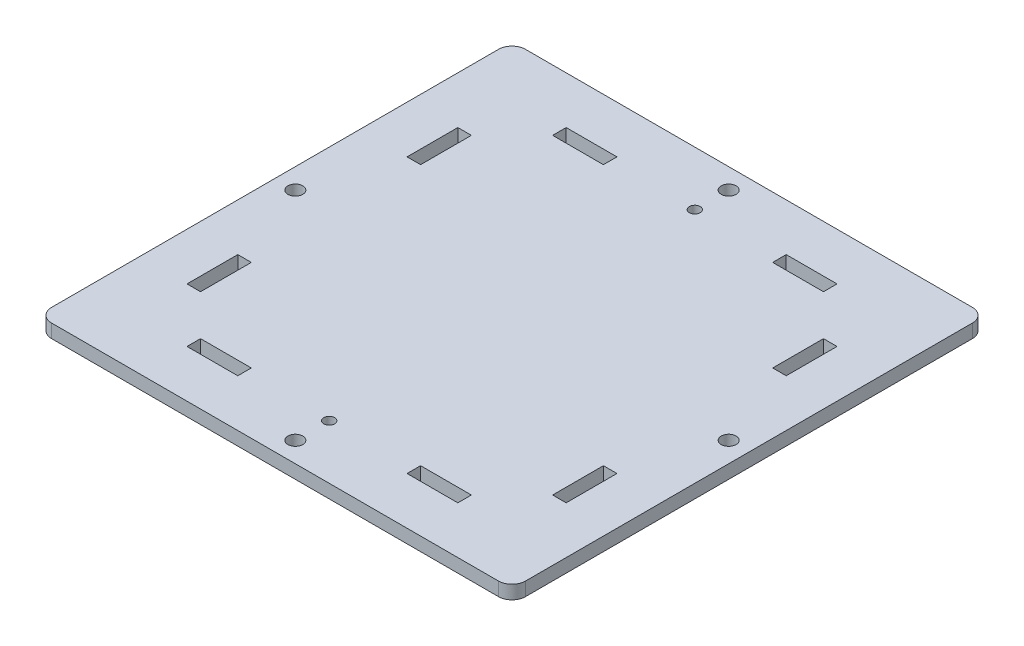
from build123d import *

# Parameters (mm, degrees)
SKIZZE2_R                       = 1.6
SKIZZE2_R_2                     = 2.2
SKIZZE2_W                       = 15
SKIZZE2_H                       = 4
SKIZZE2_W_2                     = 4
SKIZZE2_H_2                     = 15
AUFSATZ_LINEAR_AUSTRAGEN1_DEPTH = 4


with BuildPart() as part:
    # Skizze2 → Aufsatz-Linear austragen1 (new body)
    with BuildSketch(Plane.XZ):
        with BuildLine():
            Line((-66, 70), (66, 70))
            ThreePointArc((66, 70), (68.828427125, 68.828427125), (70, 66))
            Line((70, 66), (70, -66))
            ThreePointArc((70, -66), (68.828427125, -68.828427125), (66, -70))
            Line((66, -70), (-66, -70))
            ThreePointArc((-66, -70), (-68.828427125, -68.828427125), (-70, -66))
            Line((-70, -66), (-70, 66))
            ThreePointArc((-70, 66), (-68.828427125, 68.828427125), (-66, 70))
        make_face()
        with Locations(Location((0, 54, 0), (0, 0, 270))):
            Circle(SKIZZE2_R, mode=Mode.SUBTRACT)
        with Locations(Location((0, -54, 0), (0, 0, 90))):
            Circle(SKIZZE2_R, mode=Mode.SUBTRACT)
        with Locations(Location((0, 64, 0), (0, 0, 270))):
            Circle(SKIZZE2_R_2, mode=Mode.SUBTRACT)
        with Locations(Location((64, 0, 0), (0, 0, 270))):
            Circle(SKIZZE2_R_2, mode=Mode.SUBTRACT)
        with Locations(Location((0, -64, 0), (0, 0, 270))):
            Circle(SKIZZE2_R_2, mode=Mode.SUBTRACT)
        with Locations(Location((-64, 0, 0), (0, 0, 270))):
            Circle(SKIZZE2_R_2, mode=Mode.SUBTRACT)
        with Locations((32.5, 54)):
            Rectangle(SKIZZE2_W, SKIZZE2_H, mode=Mode.SUBTRACT)
        with Locations((-32.5, 54)):
            Rectangle(SKIZZE2_W, SKIZZE2_H, mode=Mode.SUBTRACT)
        with Locations((54, -32.5)):
            Rectangle(SKIZZE2_W_2, SKIZZE2_H_2, mode=Mode.SUBTRACT)
        with Locations((54, 32.5)):
            Rectangle(SKIZZE2_W_2, SKIZZE2_H_2, mode=Mode.SUBTRACT)
        with Locations((-32.5, -54)):
            Rectangle(SKIZZE2_W, SKIZZE2_H, mode=Mode.SUBTRACT)
        with Locations((32.5, -54)):
            Rectangle(SKIZZE2_W, SKIZZE2_H, mode=Mode.SUBTRACT)
        with Locations((-54, 32.5)):
            Rectangle(SKIZZE2_W_2, SKIZZE2_H_2, mode=Mode.SUBTRACT)
        with Locations((-54, -32.5)):
            Rectangle(SKIZZE2_W_2, SKIZZE2_H_2, mode=Mode.SUBTRACT)
    extrude(amount=AUFSATZ_LINEAR_AUSTRAGEN1_DEPTH)


solid = part.part
